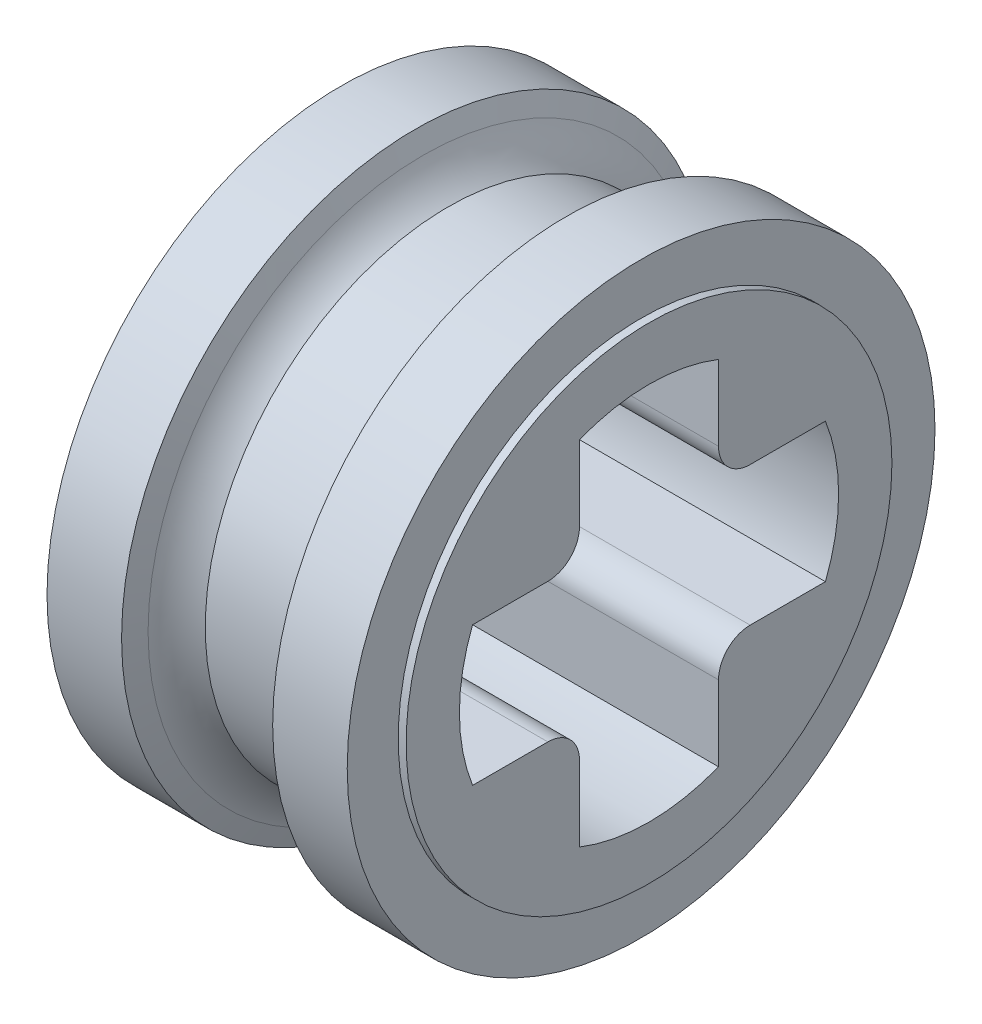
ISO-10303-21;
HEADER;
FILE_DESCRIPTION(('STEP AP214'),'2;1');
FILE_NAME('part.step','',(''),(''),'','','');
FILE_SCHEMA(('AUTOMOTIVE_DESIGN { 1 0 10303 214 1 1 1 1 }'));
ENDSEC;
DATA;
#1=APPLICATION_CONTEXT('core data for automotive mechanical design processes');
#2=APPLICATION_PROTOCOL_DEFINITION('international standard','automotive_design',2000,#1);
#3=PRODUCT_CONTEXT('',#1,'mechanical');
#4=PRODUCT('Part','Part','',(#3));
#5=PRODUCT_RELATED_PRODUCT_CATEGORY('part','',(#4));
#6=PRODUCT_DEFINITION_FORMATION('','',#4);
#7=PRODUCT_DEFINITION_CONTEXT('part definition',#1,'design');
#8=PRODUCT_DEFINITION('design','',#6,#7);
#9=PRODUCT_DEFINITION_SHAPE('','',#8);
#10=(LENGTH_UNIT() NAMED_UNIT(*) SI_UNIT(.MILLI.,.METRE.));
#11=(NAMED_UNIT(*) PLANE_ANGLE_UNIT() SI_UNIT($,.RADIAN.));
#12=(NAMED_UNIT(*) SI_UNIT($,.STERADIAN.) SOLID_ANGLE_UNIT());
#13=UNCERTAINTY_MEASURE_WITH_UNIT(LENGTH_MEASURE(1.E-05),#10,'distance_accuracy_value','');
#14=(GEOMETRIC_REPRESENTATION_CONTEXT(3) GLOBAL_UNCERTAINTY_ASSIGNED_CONTEXT((#13)) GLOBAL_UNIT_ASSIGNED_CONTEXT((#10,
#11,#12)) REPRESENTATION_CONTEXT('',''));
#15=CARTESIAN_POINT('',(0.,0.,0.));
#16=DIRECTION('',(0.,0.,1.));
#17=DIRECTION('',(1.,0.,0.));
#18=AXIS2_PLACEMENT_3D('',#15,#16,#17);
#19=CARTESIAN_POINT('',(-2.01625000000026,0.,0.));
#20=DIRECTION('',(1.,0.,0.));
#21=DIRECTION('',(0.,0.,-1.));
#22=AXIS2_PLACEMENT_3D('',#19,#20,#21);
#23=CYLINDRICAL_SURFACE('',#22,2.4);
#24=CARTESIAN_POINT('',(-2.,0.,0.));
#25=DIRECTION('',(-1.,0.,0.));
#26=DIRECTION('',(0.,0.,1.));
#27=AXIS2_PLACEMENT_3D('',#24,#25,#26);
#28=CIRCLE('',#27,2.4);
#29=CARTESIAN_POINT('',(-2.,2.23284571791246,-0.88));
#30=VERTEX_POINT('',#29);
#31=CARTESIAN_POINT('',(-2.,2.23284571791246,0.88));
#32=VERTEX_POINT('',#31);
#33=EDGE_CURVE('E49',#30,#32,#28,.F.);
#34=ORIENTED_EDGE('',*,*,#33,.F.);
#35=DIRECTION('',(1.,0.,0.));
#36=VECTOR('',#35,1.);
#37=CARTESIAN_POINT('',(-2.01625000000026,2.23284571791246,-0.88));
#38=LINE('',#37,#36);
#39=CARTESIAN_POINT('',(2.,2.23284571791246,-0.88));
#40=VERTEX_POINT('',#39);
#41=EDGE_CURVE('E319',#30,#40,#38,.T.);
#42=ORIENTED_EDGE('',*,*,#41,.T.);
#43=CARTESIAN_POINT('',(2.,0.,0.));
#44=DIRECTION('',(1.,0.,0.));
#45=DIRECTION('',(0.,0.,-1.));
#46=AXIS2_PLACEMENT_3D('',#43,#44,#45);
#47=CIRCLE('',#46,2.4);
#48=CARTESIAN_POINT('',(2.,2.23284571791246,0.88));
#49=VERTEX_POINT('',#48);
#50=EDGE_CURVE('E311',#49,#40,#47,.F.);
#51=ORIENTED_EDGE('',*,*,#50,.F.);
#52=DIRECTION('',(1.,0.,0.));
#53=VECTOR('',#52,1.);
#54=CARTESIAN_POINT('',(-2.01625000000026,2.23284571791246,0.88));
#55=LINE('',#54,#53);
#56=EDGE_CURVE('E161',#32,#49,#55,.T.);
#57=ORIENTED_EDGE('',*,*,#56,.F.);
#58=EDGE_LOOP('',(#34,#42,#51,#57));
#59=FACE_BOUND('',#58,.T.);
#60=ADVANCED_FACE('F34',(#59),#23,.F.);
#61=CARTESIAN_POINT('',(-2.01625000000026,1.28,-0.88));
#62=DIRECTION('',(0.,0.,-1.));
#63=DIRECTION('',(0.,1.,0.));
#64=AXIS2_PLACEMENT_3D('',#61,#62,#63);
#65=PLANE('',#64);
#66=DIRECTION('',(0.,1.,0.));
#67=VECTOR('',#66,1.);
#68=CARTESIAN_POINT('',(-2.,1.28,-0.88));
#69=LINE('',#68,#67);
#70=CARTESIAN_POINT('',(-2.,1.28,-0.88));
#71=VERTEX_POINT('',#70);
#72=EDGE_CURVE('E260',#71,#30,#69,.T.);
#73=ORIENTED_EDGE('',*,*,#72,.F.);
#74=DIRECTION('',(1.,0.,0.));
#75=VECTOR('',#74,1.);
#76=CARTESIAN_POINT('',(-2.01625000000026,1.28,-0.88));
#77=LINE('',#76,#75);
#78=CARTESIAN_POINT('',(2.,1.28,-0.88));
#79=VERTEX_POINT('',#78);
#80=EDGE_CURVE('E322',#71,#79,#77,.T.);
#81=ORIENTED_EDGE('',*,*,#80,.T.);
#82=DIRECTION('',(0.,-1.,0.));
#83=VECTOR('',#82,1.);
#84=CARTESIAN_POINT('',(2.,1.28,-0.88));
#85=LINE('',#84,#83);
#86=EDGE_CURVE('E308',#40,#79,#85,.T.);
#87=ORIENTED_EDGE('',*,*,#86,.F.);
#88=ORIENTED_EDGE('',*,*,#41,.F.);
#89=EDGE_LOOP('',(#73,#81,#87,#88));
#90=FACE_BOUND('',#89,.T.);
#91=ADVANCED_FACE('F205',(#90),#65,.F.);
#92=CARTESIAN_POINT('',(-2.01625000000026,1.28,-1.28));
#93=DIRECTION('',(1.,0.,0.));
#94=DIRECTION('',(0.,0.,-1.));
#95=AXIS2_PLACEMENT_3D('',#92,#93,#94);
#96=CYLINDRICAL_SURFACE('',#95,0.4);
#97=CARTESIAN_POINT('',(-2.,1.28,-1.28));
#98=DIRECTION('',(-1.,0.,0.));
#99=DIRECTION('',(0.,0.,1.));
#100=AXIS2_PLACEMENT_3D('',#97,#98,#99);
#101=CIRCLE('',#100,0.4);
#102=CARTESIAN_POINT('',(-2.,0.88,-1.28));
#103=VERTEX_POINT('',#102);
#104=EDGE_CURVE('E258',#103,#71,#101,.T.);
#105=ORIENTED_EDGE('',*,*,#104,.F.);
#106=DIRECTION('',(1.,0.,0.));
#107=VECTOR('',#106,1.);
#108=CARTESIAN_POINT('',(-2.01625000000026,0.88,-1.28));
#109=LINE('',#108,#107);
#110=CARTESIAN_POINT('',(2.,0.88,-1.28));
#111=VERTEX_POINT('',#110);
#112=EDGE_CURVE('E324',#103,#111,#109,.T.);
#113=ORIENTED_EDGE('',*,*,#112,.T.);
#114=CARTESIAN_POINT('',(2.,1.28,-1.28));
#115=DIRECTION('',(1.,0.,0.));
#116=DIRECTION('',(0.,0.,-1.));
#117=AXIS2_PLACEMENT_3D('',#114,#115,#116);
#118=CIRCLE('',#117,0.4);
#119=EDGE_CURVE('E305',#79,#111,#118,.T.);
#120=ORIENTED_EDGE('',*,*,#119,.F.);
#121=ORIENTED_EDGE('',*,*,#80,.F.);
#122=EDGE_LOOP('',(#105,#113,#120,#121));
#123=FACE_BOUND('',#122,.T.);
#124=ADVANCED_FACE('F211',(#123),#96,.T.);
#125=CARTESIAN_POINT('',(-2.01625000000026,0.88,-2.23284571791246));
#126=DIRECTION('',(0.,1.,0.));
#127=DIRECTION('',(0.,0.,1.));
#128=AXIS2_PLACEMENT_3D('',#125,#126,#127);
#129=PLANE('',#128);
#130=DIRECTION('',(0.,0.,1.));
#131=VECTOR('',#130,1.);
#132=CARTESIAN_POINT('',(-2.,0.88,-2.23284571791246));
#133=LINE('',#132,#131);
#134=CARTESIAN_POINT('',(-2.,0.88,-2.23284571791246));
#135=VERTEX_POINT('',#134);
#136=EDGE_CURVE('E256',#135,#103,#133,.T.);
#137=ORIENTED_EDGE('',*,*,#136,.F.);
#138=DIRECTION('',(1.,0.,0.));
#139=VECTOR('',#138,1.);
#140=CARTESIAN_POINT('',(-2.01625000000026,0.88,-2.23284571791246));
#141=LINE('',#140,#139);
#142=CARTESIAN_POINT('',(2.,0.88,-2.23284571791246));
#143=VERTEX_POINT('',#142);
#144=EDGE_CURVE('E326',#135,#143,#141,.T.);
#145=ORIENTED_EDGE('',*,*,#144,.T.);
#146=DIRECTION('',(0.,0.,-1.));
#147=VECTOR('',#146,1.);
#148=CARTESIAN_POINT('',(2.,0.88,-2.23284571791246));
#149=LINE('',#148,#147);
#150=EDGE_CURVE('E302',#111,#143,#149,.T.);
#151=ORIENTED_EDGE('',*,*,#150,.F.);
#152=ORIENTED_EDGE('',*,*,#112,.F.);
#153=EDGE_LOOP('',(#137,#145,#151,#152));
#154=FACE_BOUND('',#153,.T.);
#155=ADVANCED_FACE('F399',(#154),#129,.F.);
#156=CARTESIAN_POINT('',(-2.01625000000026,0.,0.));
#157=DIRECTION('',(1.,0.,0.));
#158=DIRECTION('',(0.,0.,-1.));
#159=AXIS2_PLACEMENT_3D('',#156,#157,#158);
#160=CYLINDRICAL_SURFACE('',#159,2.4);
#161=CARTESIAN_POINT('',(-2.,0.,0.));
#162=DIRECTION('',(-1.,0.,0.));
#163=DIRECTION('',(0.,0.,1.));
#164=AXIS2_PLACEMENT_3D('',#161,#162,#163);
#165=CIRCLE('',#164,2.4);
#166=CARTESIAN_POINT('',(-2.,-0.88,-2.23284571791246));
#167=VERTEX_POINT('',#166);
#168=EDGE_CURVE('E254',#167,#135,#165,.F.);
#169=ORIENTED_EDGE('',*,*,#168,.F.);
#170=DIRECTION('',(1.,0.,0.));
#171=VECTOR('',#170,1.);
#172=CARTESIAN_POINT('',(-2.01625000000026,-0.880000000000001,-2.23284571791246));
#173=LINE('',#172,#171);
#174=CARTESIAN_POINT('',(2.,-0.88,-2.23284571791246));
#175=VERTEX_POINT('',#174);
#176=EDGE_CURVE('E328',#167,#175,#173,.T.);
#177=ORIENTED_EDGE('',*,*,#176,.T.);
#178=CARTESIAN_POINT('',(2.,0.,0.));
#179=DIRECTION('',(1.,0.,0.));
#180=DIRECTION('',(0.,0.,-1.));
#181=AXIS2_PLACEMENT_3D('',#178,#179,#180);
#182=CIRCLE('',#181,2.4);
#183=EDGE_CURVE('E299',#143,#175,#182,.F.);
#184=ORIENTED_EDGE('',*,*,#183,.F.);
#185=ORIENTED_EDGE('',*,*,#144,.F.);
#186=EDGE_LOOP('',(#169,#177,#184,#185));
#187=FACE_BOUND('',#186,.T.);
#188=ADVANCED_FACE('F392',(#187),#160,.F.);
#189=CARTESIAN_POINT('',(-2.01625000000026,-0.88,-1.28));
#190=DIRECTION('',(0.,-1.,0.));
#191=DIRECTION('',(0.,0.,-1.));
#192=AXIS2_PLACEMENT_3D('',#189,#190,#191);
#193=PLANE('',#192);
#194=DIRECTION('',(0.,0.,-1.));
#195=VECTOR('',#194,1.);
#196=CARTESIAN_POINT('',(-2.,-0.88,-1.28));
#197=LINE('',#196,#195);
#198=CARTESIAN_POINT('',(-2.,-0.88,-1.28));
#199=VERTEX_POINT('',#198);
#200=EDGE_CURVE('E252',#199,#167,#197,.T.);
#201=ORIENTED_EDGE('',*,*,#200,.F.);
#202=DIRECTION('',(1.,0.,0.));
#203=VECTOR('',#202,1.);
#204=CARTESIAN_POINT('',(-2.01625000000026,-0.88,-1.28));
#205=LINE('',#204,#203);
#206=CARTESIAN_POINT('',(2.,-0.88,-1.28));
#207=VERTEX_POINT('',#206);
#208=EDGE_CURVE('E330',#199,#207,#205,.T.);
#209=ORIENTED_EDGE('',*,*,#208,.T.);
#210=DIRECTION('',(0.,0.,1.));
#211=VECTOR('',#210,1.);
#212=CARTESIAN_POINT('',(2.,-0.88,-1.28));
#213=LINE('',#212,#211);
#214=EDGE_CURVE('E296',#175,#207,#213,.T.);
#215=ORIENTED_EDGE('',*,*,#214,.F.);
#216=ORIENTED_EDGE('',*,*,#176,.F.);
#217=EDGE_LOOP('',(#201,#209,#215,#216));
#218=FACE_BOUND('',#217,.T.);
#219=ADVANCED_FACE('F389',(#218),#193,.F.);
#220=CARTESIAN_POINT('',(-2.01625000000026,-1.28,-1.28));
#221=DIRECTION('',(1.,0.,0.));
#222=DIRECTION('',(0.,0.,-1.));
#223=AXIS2_PLACEMENT_3D('',#220,#221,#222);
#224=CYLINDRICAL_SURFACE('',#223,0.4);
#225=CARTESIAN_POINT('',(-2.,-1.28,-1.28));
#226=DIRECTION('',(-1.,0.,0.));
#227=DIRECTION('',(0.,0.,1.));
#228=AXIS2_PLACEMENT_3D('',#225,#226,#227);
#229=CIRCLE('',#228,0.4);
#230=CARTESIAN_POINT('',(-2.,-1.28,-0.88));
#231=VERTEX_POINT('',#230);
#232=EDGE_CURVE('E250',#231,#199,#229,.T.);
#233=ORIENTED_EDGE('',*,*,#232,.F.);
#234=DIRECTION('',(1.,0.,0.));
#235=VECTOR('',#234,1.);
#236=CARTESIAN_POINT('',(-2.01625000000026,-1.28,-0.88));
#237=LINE('',#236,#235);
#238=CARTESIAN_POINT('',(2.,-1.28,-0.88));
#239=VERTEX_POINT('',#238);
#240=EDGE_CURVE('E332',#231,#239,#237,.T.);
#241=ORIENTED_EDGE('',*,*,#240,.T.);
#242=CARTESIAN_POINT('',(2.,-1.28,-1.28));
#243=DIRECTION('',(1.,0.,0.));
#244=DIRECTION('',(0.,0.,-1.));
#245=AXIS2_PLACEMENT_3D('',#242,#243,#244);
#246=CIRCLE('',#245,0.4);
#247=EDGE_CURVE('E293',#207,#239,#246,.T.);
#248=ORIENTED_EDGE('',*,*,#247,.F.);
#249=ORIENTED_EDGE('',*,*,#208,.F.);
#250=EDGE_LOOP('',(#233,#241,#248,#249));
#251=FACE_BOUND('',#250,.T.);
#252=ADVANCED_FACE('F384',(#251),#224,.T.);
#253=CARTESIAN_POINT('',(-2.01625000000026,-2.23284571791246,-0.88));
#254=DIRECTION('',(0.,0.,-1.));
#255=DIRECTION('',(0.,1.,0.));
#256=AXIS2_PLACEMENT_3D('',#253,#254,#255);
#257=PLANE('',#256);
#258=DIRECTION('',(0.,1.,0.));
#259=VECTOR('',#258,1.);
#260=CARTESIAN_POINT('',(-2.,-2.23284571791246,-0.88));
#261=LINE('',#260,#259);
#262=CARTESIAN_POINT('',(-2.,-2.23284571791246,-0.88));
#263=VERTEX_POINT('',#262);
#264=EDGE_CURVE('E248',#263,#231,#261,.T.);
#265=ORIENTED_EDGE('',*,*,#264,.F.);
#266=DIRECTION('',(1.,0.,0.));
#267=VECTOR('',#266,1.);
#268=CARTESIAN_POINT('',(-2.01625000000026,-2.23284571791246,-0.88));
#269=LINE('',#268,#267);
#270=CARTESIAN_POINT('',(2.,-2.23284571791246,-0.88));
#271=VERTEX_POINT('',#270);
#272=EDGE_CURVE('E334',#263,#271,#269,.T.);
#273=ORIENTED_EDGE('',*,*,#272,.T.);
#274=DIRECTION('',(0.,-1.,0.));
#275=VECTOR('',#274,1.);
#276=CARTESIAN_POINT('',(2.,-2.23284571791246,-0.88));
#277=LINE('',#276,#275);
#278=EDGE_CURVE('E290',#239,#271,#277,.T.);
#279=ORIENTED_EDGE('',*,*,#278,.F.);
#280=ORIENTED_EDGE('',*,*,#240,.F.);
#281=EDGE_LOOP('',(#265,#273,#279,#280));
#282=FACE_BOUND('',#281,.T.);
#283=ADVANCED_FACE('F377',(#282),#257,.F.);
#284=CARTESIAN_POINT('',(-2.01625000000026,0.,0.));
#285=DIRECTION('',(1.,0.,0.));
#286=DIRECTION('',(0.,0.,-1.));
#287=AXIS2_PLACEMENT_3D('',#284,#285,#286);
#288=CYLINDRICAL_SURFACE('',#287,2.4);
#289=CARTESIAN_POINT('',(-2.,0.,0.));
#290=DIRECTION('',(-1.,0.,0.));
#291=DIRECTION('',(0.,0.,1.));
#292=AXIS2_PLACEMENT_3D('',#289,#290,#291);
#293=CIRCLE('',#292,2.4);
#294=CARTESIAN_POINT('',(-2.,-2.23284571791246,0.88));
#295=VERTEX_POINT('',#294);
#296=EDGE_CURVE('E246',#295,#263,#293,.F.);
#297=ORIENTED_EDGE('',*,*,#296,.F.);
#298=DIRECTION('',(1.,0.,0.));
#299=VECTOR('',#298,1.);
#300=CARTESIAN_POINT('',(-2.01625000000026,-2.23284571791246,0.88));
#301=LINE('',#300,#299);
#302=CARTESIAN_POINT('',(2.,-2.23284571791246,0.88));
#303=VERTEX_POINT('',#302);
#304=EDGE_CURVE('E336',#295,#303,#301,.T.);
#305=ORIENTED_EDGE('',*,*,#304,.T.);
#306=CARTESIAN_POINT('',(2.,0.,0.));
#307=DIRECTION('',(1.,0.,0.));
#308=DIRECTION('',(0.,0.,-1.));
#309=AXIS2_PLACEMENT_3D('',#306,#307,#308);
#310=CIRCLE('',#309,2.4);
#311=EDGE_CURVE('E287',#271,#303,#310,.F.);
#312=ORIENTED_EDGE('',*,*,#311,.F.);
#313=ORIENTED_EDGE('',*,*,#272,.F.);
#314=EDGE_LOOP('',(#297,#305,#312,#313));
#315=FACE_BOUND('',#314,.T.);
#316=ADVANCED_FACE('F374',(#315),#288,.F.);
#317=CARTESIAN_POINT('',(-2.01625000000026,-1.28,0.88));
#318=DIRECTION('',(0.,0.,1.));
#319=DIRECTION('',(0.,-1.,0.));
#320=AXIS2_PLACEMENT_3D('',#317,#318,#319);
#321=PLANE('',#320);
#322=DIRECTION('',(0.,-1.,0.));
#323=VECTOR('',#322,1.);
#324=CARTESIAN_POINT('',(-2.,-1.28,0.88));
#325=LINE('',#324,#323);
#326=CARTESIAN_POINT('',(-2.,-1.28,0.88));
#327=VERTEX_POINT('',#326);
#328=EDGE_CURVE('E244',#327,#295,#325,.T.);
#329=ORIENTED_EDGE('',*,*,#328,.F.);
#330=DIRECTION('',(1.,0.,0.));
#331=VECTOR('',#330,1.);
#332=CARTESIAN_POINT('',(-2.01625000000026,-1.28,0.88));
#333=LINE('',#332,#331);
#334=CARTESIAN_POINT('',(2.,-1.28,0.88));
#335=VERTEX_POINT('',#334);
#336=EDGE_CURVE('E338',#327,#335,#333,.T.);
#337=ORIENTED_EDGE('',*,*,#336,.T.);
#338=DIRECTION('',(0.,1.,0.));
#339=VECTOR('',#338,1.);
#340=CARTESIAN_POINT('',(2.,-1.28,0.88));
#341=LINE('',#340,#339);
#342=EDGE_CURVE('E284',#303,#335,#341,.T.);
#343=ORIENTED_EDGE('',*,*,#342,.F.);
#344=ORIENTED_EDGE('',*,*,#304,.F.);
#345=EDGE_LOOP('',(#329,#337,#343,#344));
#346=FACE_BOUND('',#345,.T.);
#347=ADVANCED_FACE('F369',(#346),#321,.F.);
#348=CARTESIAN_POINT('',(-2.01625000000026,-1.28,1.28));
#349=DIRECTION('',(1.,0.,0.));
#350=DIRECTION('',(0.,0.,-1.));
#351=AXIS2_PLACEMENT_3D('',#348,#349,#350);
#352=CYLINDRICAL_SURFACE('',#351,0.4);
#353=CARTESIAN_POINT('',(-2.,-1.28,1.28));
#354=DIRECTION('',(-1.,0.,0.));
#355=DIRECTION('',(0.,0.,1.));
#356=AXIS2_PLACEMENT_3D('',#353,#354,#355);
#357=CIRCLE('',#356,0.4);
#358=CARTESIAN_POINT('',(-2.,-0.88,1.28));
#359=VERTEX_POINT('',#358);
#360=EDGE_CURVE('E242',#359,#327,#357,.T.);
#361=ORIENTED_EDGE('',*,*,#360,.F.);
#362=DIRECTION('',(1.,0.,0.));
#363=VECTOR('',#362,1.);
#364=CARTESIAN_POINT('',(-2.01625000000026,-0.88,1.28));
#365=LINE('',#364,#363);
#366=CARTESIAN_POINT('',(2.,-0.88,1.28));
#367=VERTEX_POINT('',#366);
#368=EDGE_CURVE('E340',#359,#367,#365,.T.);
#369=ORIENTED_EDGE('',*,*,#368,.T.);
#370=CARTESIAN_POINT('',(2.,-1.28,1.28));
#371=DIRECTION('',(1.,0.,0.));
#372=DIRECTION('',(0.,0.,-1.));
#373=AXIS2_PLACEMENT_3D('',#370,#371,#372);
#374=CIRCLE('',#373,0.4);
#375=EDGE_CURVE('E281',#335,#367,#374,.T.);
#376=ORIENTED_EDGE('',*,*,#375,.F.);
#377=ORIENTED_EDGE('',*,*,#336,.F.);
#378=EDGE_LOOP('',(#361,#369,#376,#377));
#379=FACE_BOUND('',#378,.T.);
#380=ADVANCED_FACE('F362',(#379),#352,.T.);
#381=CARTESIAN_POINT('',(-2.01625000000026,-0.88,2.23284571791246));
#382=DIRECTION('',(0.,-1.,0.));
#383=DIRECTION('',(0.,0.,-1.));
#384=AXIS2_PLACEMENT_3D('',#381,#382,#383);
#385=PLANE('',#384);
#386=DIRECTION('',(0.,0.,-1.));
#387=VECTOR('',#386,1.);
#388=CARTESIAN_POINT('',(-2.,-0.88,2.23284571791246));
#389=LINE('',#388,#387);
#390=CARTESIAN_POINT('',(-2.,-0.88,2.23284571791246));
#391=VERTEX_POINT('',#390);
#392=EDGE_CURVE('E240',#391,#359,#389,.T.);
#393=ORIENTED_EDGE('',*,*,#392,.F.);
#394=DIRECTION('',(1.,0.,0.));
#395=VECTOR('',#394,1.);
#396=CARTESIAN_POINT('',(-2.01625000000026,-0.88,2.23284571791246));
#397=LINE('',#396,#395);
#398=CARTESIAN_POINT('',(2.,-0.88,2.23284571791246));
#399=VERTEX_POINT('',#398);
#400=EDGE_CURVE('E342',#391,#399,#397,.T.);
#401=ORIENTED_EDGE('',*,*,#400,.T.);
#402=DIRECTION('',(0.,0.,1.));
#403=VECTOR('',#402,1.);
#404=CARTESIAN_POINT('',(2.,-0.88,2.23284571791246));
#405=LINE('',#404,#403);
#406=EDGE_CURVE('E278',#367,#399,#405,.T.);
#407=ORIENTED_EDGE('',*,*,#406,.F.);
#408=ORIENTED_EDGE('',*,*,#368,.F.);
#409=EDGE_LOOP('',(#393,#401,#407,#408));
#410=FACE_BOUND('',#409,.T.);
#411=ADVANCED_FACE('F359',(#410),#385,.F.);
#412=CARTESIAN_POINT('',(-2.01625000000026,0.,0.));
#413=DIRECTION('',(1.,0.,0.));
#414=DIRECTION('',(0.,0.,-1.));
#415=AXIS2_PLACEMENT_3D('',#412,#413,#414);
#416=CYLINDRICAL_SURFACE('',#415,2.4);
#417=CARTESIAN_POINT('',(-2.,0.,0.));
#418=DIRECTION('',(-1.,0.,0.));
#419=DIRECTION('',(0.,0.,1.));
#420=AXIS2_PLACEMENT_3D('',#417,#418,#419);
#421=CIRCLE('',#420,2.4);
#422=CARTESIAN_POINT('',(-2.,0.88,2.23284571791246));
#423=VERTEX_POINT('',#422);
#424=EDGE_CURVE('E238',#423,#391,#421,.F.);
#425=ORIENTED_EDGE('',*,*,#424,.F.);
#426=DIRECTION('',(1.,0.,0.));
#427=VECTOR('',#426,1.);
#428=CARTESIAN_POINT('',(-2.01625000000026,0.88,2.23284571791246));
#429=LINE('',#428,#427);
#430=CARTESIAN_POINT('',(2.,0.88,2.23284571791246));
#431=VERTEX_POINT('',#430);
#432=EDGE_CURVE('E163',#423,#431,#429,.T.);
#433=ORIENTED_EDGE('',*,*,#432,.T.);
#434=CARTESIAN_POINT('',(2.,0.,0.));
#435=DIRECTION('',(1.,0.,0.));
#436=DIRECTION('',(0.,0.,-1.));
#437=AXIS2_PLACEMENT_3D('',#434,#435,#436);
#438=CIRCLE('',#437,2.4);
#439=EDGE_CURVE('E275',#399,#431,#438,.F.);
#440=ORIENTED_EDGE('',*,*,#439,.F.);
#441=ORIENTED_EDGE('',*,*,#400,.F.);
#442=EDGE_LOOP('',(#425,#433,#440,#441));
#443=FACE_BOUND('',#442,.T.);
#444=ADVANCED_FACE('F347',(#443),#416,.F.);
#445=CARTESIAN_POINT('',(-2.01625000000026,0.88,1.28));
#446=DIRECTION('',(0.,1.,0.));
#447=DIRECTION('',(0.,0.,1.));
#448=AXIS2_PLACEMENT_3D('',#445,#446,#447);
#449=PLANE('',#448);
#450=DIRECTION('',(0.,0.,1.));
#451=VECTOR('',#450,1.);
#452=CARTESIAN_POINT('',(-2.,0.88,1.28));
#453=LINE('',#452,#451);
#454=CARTESIAN_POINT('',(-2.,0.88,1.28));
#455=VERTEX_POINT('',#454);
#456=EDGE_CURVE('E157',#455,#423,#453,.T.);
#457=ORIENTED_EDGE('',*,*,#456,.F.);
#458=DIRECTION('',(1.,0.,0.));
#459=VECTOR('',#458,1.);
#460=CARTESIAN_POINT('',(-2.01625000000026,0.88,1.28));
#461=LINE('',#460,#459);
#462=CARTESIAN_POINT('',(2.,0.88,1.28));
#463=VERTEX_POINT('',#462);
#464=EDGE_CURVE('E156',#455,#463,#461,.T.);
#465=ORIENTED_EDGE('',*,*,#464,.T.);
#466=DIRECTION('',(0.,0.,-1.));
#467=VECTOR('',#466,1.);
#468=CARTESIAN_POINT('',(2.,0.88,1.28));
#469=LINE('',#468,#467);
#470=EDGE_CURVE('E272',#431,#463,#469,.T.);
#471=ORIENTED_EDGE('',*,*,#470,.F.);
#472=ORIENTED_EDGE('',*,*,#432,.F.);
#473=EDGE_LOOP('',(#457,#465,#471,#472));
#474=FACE_BOUND('',#473,.T.);
#475=ADVANCED_FACE('F354',(#474),#449,.F.);
#476=CARTESIAN_POINT('',(-2.01625000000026,1.28,1.28));
#477=DIRECTION('',(1.,0.,0.));
#478=DIRECTION('',(0.,0.,-1.));
#479=AXIS2_PLACEMENT_3D('',#476,#477,#478);
#480=CYLINDRICAL_SURFACE('',#479,0.4);
#481=CARTESIAN_POINT('',(-2.,1.28,1.28));
#482=DIRECTION('',(-1.,0.,0.));
#483=DIRECTION('',(0.,0.,1.));
#484=AXIS2_PLACEMENT_3D('',#481,#482,#483);
#485=CIRCLE('',#484,0.4);
#486=CARTESIAN_POINT('',(-2.,1.28,0.88));
#487=VERTEX_POINT('',#486);
#488=EDGE_CURVE('E148',#487,#455,#485,.T.);
#489=ORIENTED_EDGE('',*,*,#488,.F.);
#490=DIRECTION('',(1.,0.,0.));
#491=VECTOR('',#490,1.);
#492=CARTESIAN_POINT('',(-2.01625000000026,1.28,0.88));
#493=LINE('',#492,#491);
#494=CARTESIAN_POINT('',(2.,1.28,0.88));
#495=VERTEX_POINT('',#494);
#496=EDGE_CURVE('E57',#487,#495,#493,.T.);
#497=ORIENTED_EDGE('',*,*,#496,.T.);
#498=CARTESIAN_POINT('',(2.,1.28,1.28));
#499=DIRECTION('',(1.,0.,0.));
#500=DIRECTION('',(0.,0.,-1.));
#501=AXIS2_PLACEMENT_3D('',#498,#499,#500);
#502=CIRCLE('',#501,0.4);
#503=EDGE_CURVE('E270',#463,#495,#502,.T.);
#504=ORIENTED_EDGE('',*,*,#503,.F.);
#505=ORIENTED_EDGE('',*,*,#464,.F.);
#506=EDGE_LOOP('',(#489,#497,#504,#505));
#507=FACE_BOUND('',#506,.T.);
#508=ADVANCED_FACE('F155',(#507),#480,.T.);
#509=CARTESIAN_POINT('',(-2.01625000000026,2.23284571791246,0.88));
#510=DIRECTION('',(0.,0.,1.));
#511=DIRECTION('',(0.,-1.,0.));
#512=AXIS2_PLACEMENT_3D('',#509,#510,#511);
#513=PLANE('',#512);
#514=DIRECTION('',(0.,-1.,0.));
#515=VECTOR('',#514,1.);
#516=CARTESIAN_POINT('',(-2.,2.23284571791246,0.88));
#517=LINE('',#516,#515);
#518=EDGE_CURVE('E146',#32,#487,#517,.T.);
#519=ORIENTED_EDGE('',*,*,#518,.F.);
#520=ORIENTED_EDGE('',*,*,#56,.T.);
#521=DIRECTION('',(0.,1.,0.));
#522=VECTOR('',#521,1.);
#523=CARTESIAN_POINT('',(2.,2.23284571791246,0.88));
#524=LINE('',#523,#522);
#525=EDGE_CURVE('E11',#495,#49,#524,.T.);
#526=ORIENTED_EDGE('',*,*,#525,.F.);
#527=ORIENTED_EDGE('',*,*,#496,.F.);
#528=EDGE_LOOP('',(#519,#520,#526,#527));
#529=FACE_BOUND('',#528,.T.);
#530=ADVANCED_FACE('F160',(#529),#513,.F.);
#531=CARTESIAN_POINT('',(-2.01625000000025,0.,0.));
#532=DIRECTION('',(1.,0.,0.));
#533=DIRECTION('',(0.,0.,-1.));
#534=AXIS2_PLACEMENT_3D('',#531,#532,#533);
#535=CYLINDRICAL_SURFACE('',#534,3.075);
#536=CARTESIAN_POINT('',(-1.9,0.,0.));
#537=DIRECTION('',(1.,0.,0.));
#538=DIRECTION('',(0.,0.,-1.));
#539=AXIS2_PLACEMENT_3D('',#536,#537,#538);
#540=CIRCLE('',#539,3.075);
#541=CARTESIAN_POINT('',(-1.9,0.,-3.075));
#542=VERTEX_POINT('',#541);
#543=EDGE_CURVE('E231',#542,#542,#540,.T.);
#544=ORIENTED_EDGE('',*,*,#543,.F.);
#545=EDGE_LOOP('',(#544));
#546=FACE_BOUND('',#545,.T.);
#547=CARTESIAN_POINT('',(-2.,0.,0.));
#548=DIRECTION('',(1.,0.,0.));
#549=DIRECTION('',(0.,0.,-1.));
#550=AXIS2_PLACEMENT_3D('',#547,#548,#549);
#551=CIRCLE('',#550,3.075);
#552=CARTESIAN_POINT('',(-2.,0.,-3.075));
#553=VERTEX_POINT('',#552);
#554=EDGE_CURVE('E152',#553,#553,#551,.T.);
#555=ORIENTED_EDGE('',*,*,#554,.T.);
#556=EDGE_LOOP('',(#555));
#557=FACE_BOUND('',#556,.T.);
#558=ADVANCED_FACE('F221',(#546,#557),#535,.T.);
#559=CARTESIAN_POINT('',(-0.956250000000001,0.,0.));
#560=DIRECTION('',(-1.,0.,0.));
#561=DIRECTION('',(0.,0.,1.));
#562=AXIS2_PLACEMENT_3D('',#559,#560,#561);
#563=CYLINDRICAL_SURFACE('',#562,3.72);
#564=CARTESIAN_POINT('',(-0.956250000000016,0.,0.));
#565=DIRECTION('',(-1.,0.,0.));
#566=DIRECTION('',(0.,0.,-1.));
#567=AXIS2_PLACEMENT_3D('',#564,#565,#566);
#568=CIRCLE('',#567,3.71999999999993);
#569=CARTESIAN_POINT('',(-0.956250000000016,0.,-3.71999999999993));
#570=VERTEX_POINT('',#569);
#571=EDGE_CURVE('E321',#570,#570,#568,.T.);
#572=ORIENTED_EDGE('',*,*,#571,.T.);
#573=EDGE_LOOP('',(#572));
#574=FACE_BOUND('',#573,.T.);
#575=CARTESIAN_POINT('',(-1.9,0.,0.));
#576=DIRECTION('',(1.,0.,0.));
#577=DIRECTION('',(0.,0.,-1.));
#578=AXIS2_PLACEMENT_3D('',#575,#576,#577);
#579=CIRCLE('',#578,3.72);
#580=CARTESIAN_POINT('',(-1.9,0.,-3.72));
#581=VERTEX_POINT('',#580);
#582=EDGE_CURVE('E264',#581,#581,#579,.T.);
#583=ORIENTED_EDGE('',*,*,#582,.T.);
#584=EDGE_LOOP('',(#583));
#585=FACE_BOUND('',#584,.T.);
#586=ADVANCED_FACE('F200',(#574,#585),#563,.T.);
#587=CARTESIAN_POINT('',(1.91624999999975,0.,0.));
#588=DIRECTION('',(1.,0.,0.));
#589=DIRECTION('',(0.,0.,-1.));
#590=AXIS2_PLACEMENT_3D('',#587,#588,#589);
#591=CYLINDRICAL_SURFACE('',#590,3.075);
#592=CARTESIAN_POINT('',(1.9,0.,0.));
#593=DIRECTION('',(1.,0.,0.));
#594=DIRECTION('',(0.,0.,-1.));
#595=AXIS2_PLACEMENT_3D('',#592,#593,#594);
#596=CIRCLE('',#595,3.075);
#597=CARTESIAN_POINT('',(1.9,0.,-3.075));
#598=VERTEX_POINT('',#597);
#599=EDGE_CURVE('E314',#598,#598,#596,.T.);
#600=ORIENTED_EDGE('',*,*,#599,.T.);
#601=EDGE_LOOP('',(#600));
#602=FACE_BOUND('',#601,.T.);
#603=CARTESIAN_POINT('',(2.,0.,0.));
#604=DIRECTION('',(1.,0.,0.));
#605=DIRECTION('',(0.,0.,-1.));
#606=AXIS2_PLACEMENT_3D('',#603,#604,#605);
#607=CIRCLE('',#606,3.075);
#608=CARTESIAN_POINT('',(2.,0.,-3.075));
#609=VERTEX_POINT('',#608);
#610=EDGE_CURVE('E267',#609,#609,#607,.T.);
#611=ORIENTED_EDGE('',*,*,#610,.F.);
#612=EDGE_LOOP('',(#611));
#613=FACE_BOUND('',#612,.T.);
#614=ADVANCED_FACE('F36',(#602,#613),#591,.T.);
#615=CARTESIAN_POINT('',(1.91625,0.,0.));
#616=DIRECTION('',(-1.,0.,0.));
#617=DIRECTION('',(0.,0.,1.));
#618=AXIS2_PLACEMENT_3D('',#615,#616,#617);
#619=CYLINDRICAL_SURFACE('',#618,3.72);
#620=CARTESIAN_POINT('',(0.956250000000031,0.,0.));
#621=DIRECTION('',(-1.,0.,0.));
#622=DIRECTION('',(0.,0.,-1.));
#623=AXIS2_PLACEMENT_3D('',#620,#621,#622);
#624=CIRCLE('',#623,3.72);
#625=CARTESIAN_POINT('',(0.956250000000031,0.,-3.72));
#626=VERTEX_POINT('',#625);
#627=EDGE_CURVE('E172',#626,#626,#624,.T.);
#628=ORIENTED_EDGE('',*,*,#627,.F.);
#629=EDGE_LOOP('',(#628));
#630=FACE_BOUND('',#629,.T.);
#631=CARTESIAN_POINT('',(1.9,0.,0.));
#632=DIRECTION('',(1.,0.,0.));
#633=DIRECTION('',(0.,0.,-1.));
#634=AXIS2_PLACEMENT_3D('',#631,#632,#633);
#635=CIRCLE('',#634,3.72);
#636=CARTESIAN_POINT('',(1.9,0.,-3.72));
#637=VERTEX_POINT('',#636);
#638=EDGE_CURVE('E165',#637,#637,#635,.T.);
#639=ORIENTED_EDGE('',*,*,#638,.F.);
#640=EDGE_LOOP('',(#639));
#641=FACE_BOUND('',#640,.T.);
#642=ADVANCED_FACE('F192',(#630,#641),#619,.T.);
#643=CARTESIAN_POINT('',(0.,0.,0.));
#644=DIRECTION('',(-1.,0.,0.));
#645=DIRECTION('',(0.,0.,-1.));
#646=AXIS2_PLACEMENT_3D('',#643,#644,#645);
#647=TOROIDAL_SURFACE('',#646,3.827,0.927);
#648=CARTESIAN_POINT('',(-0.542056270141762,0.,0.));
#649=DIRECTION('',(-1.,0.,0.));
#650=DIRECTION('',(0.,0.,1.));
#651=AXIS2_PLACEMENT_3D('',#648,#649,#650);
#652=CIRCLE('',#651,3.075);
#653=CARTESIAN_POINT('',(-0.542056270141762,0.,-3.075));
#654=VERTEX_POINT('',#653);
#655=EDGE_CURVE('E42',#654,#654,#652,.F.);
#656=ORIENTED_EDGE('',*,*,#655,.F.);
#657=EDGE_LOOP('',(#656));
#658=FACE_BOUND('',#657,.T.);
#659=CARTESIAN_POINT('',(-0.859898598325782,0.,0.));
#660=DIRECTION('',(-1.,0.,0.));
#661=DIRECTION('',(0.,0.,-1.));
#662=AXIS2_PLACEMENT_3D('',#659,#660,#661);
#663=CIRCLE('',#662,3.48072929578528);
#664=CARTESIAN_POINT('',(-0.859898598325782,0.,-3.48072929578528));
#665=VERTEX_POINT('',#664);
#666=EDGE_CURVE('E621',#665,#665,#663,.F.);
#667=ORIENTED_EDGE('',*,*,#666,.T.);
#668=EDGE_LOOP('',(#667));
#669=FACE_BOUND('',#668,.T.);
#670=ADVANCED_FACE('F186',(#658,#669),#647,.F.);
#671=CARTESIAN_POINT('',(-0.859898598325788,0.,0.));
#672=DIRECTION('',(-1.,0.,0.));
#673=DIRECTION('',(0.,-1.,0.));
#674=AXIS2_PLACEMENT_3D('',#671,#672,#673);
#675=CONICAL_SURFACE('',#674,3.48072929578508,1.18797500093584);
#676=ORIENTED_EDGE('',*,*,#571,.F.);
#677=EDGE_LOOP('',(#676));
#678=FACE_BOUND('',#677,.T.);
#679=ORIENTED_EDGE('',*,*,#666,.F.);
#680=EDGE_LOOP('',(#679));
#681=FACE_BOUND('',#680,.T.);
#682=ADVANCED_FACE('F187',(#678,#681),#675,.T.);
#683=CARTESIAN_POINT('',(-10.7136634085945,0.,0.));
#684=DIRECTION('',(1.,0.,0.));
#685=DIRECTION('',(0.,0.,-1.));
#686=AXIS2_PLACEMENT_3D('',#683,#684,#685);
#687=CYLINDRICAL_SURFACE('',#686,3.075);
#688=CARTESIAN_POINT('',(0.542056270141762,0.,0.));
#689=DIRECTION('',(-1.,0.,0.));
#690=DIRECTION('',(0.,0.,1.));
#691=AXIS2_PLACEMENT_3D('',#688,#689,#690);
#692=CIRCLE('',#691,3.075);
#693=CARTESIAN_POINT('',(0.542056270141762,0.,-3.075));
#694=VERTEX_POINT('',#693);
#695=EDGE_CURVE('E169',#694,#694,#692,.T.);
#696=CARTESIAN_POINT('',(-0.542056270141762,0.,-3.075));
#697=CARTESIAN_POINT('',(-0.530763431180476,0.,-3.075));
#698=CARTESIAN_POINT('',(-0.519470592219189,0.,-3.075));
#699=CARTESIAN_POINT('',(-0.496884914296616,0.,-3.075));
#700=CARTESIAN_POINT('',(-0.485592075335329,0.,-3.075));
#701=CARTESIAN_POINT('',(-0.463006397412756,0.,-3.075));
#702=CARTESIAN_POINT('',(-0.451713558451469,0.,-3.075));
#703=CARTESIAN_POINT('',(-0.429127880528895,0.,-3.075));
#704=CARTESIAN_POINT('',(-0.417835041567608,0.,-3.075));
#705=CARTESIAN_POINT('',(-0.395249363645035,0.,-3.075));
#706=CARTESIAN_POINT('',(-0.383956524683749,0.,-3.075));
#707=CARTESIAN_POINT('',(-0.361370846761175,0.,-3.075));
#708=CARTESIAN_POINT('',(-0.350078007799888,0.,-3.075));
#709=CARTESIAN_POINT('',(-0.327492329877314,0.,-3.075));
#710=CARTESIAN_POINT('',(-0.316199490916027,0.,-3.075));
#711=CARTESIAN_POINT('',(-0.293613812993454,0.,-3.075));
#712=CARTESIAN_POINT('',(-0.282320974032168,0.,-3.075));
#713=CARTESIAN_POINT('',(-0.259735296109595,0.,-3.075));
#714=CARTESIAN_POINT('',(-0.248442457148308,0.,-3.075));
#715=CARTESIAN_POINT('',(-0.225856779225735,0.,-3.075));
#716=CARTESIAN_POINT('',(-0.214563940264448,0.,-3.075));
#717=CARTESIAN_POINT('',(-0.191978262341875,0.,-3.075));
#718=CARTESIAN_POINT('',(-0.180685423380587,0.,-3.075));
#719=CARTESIAN_POINT('',(-0.158099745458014,0.,-3.075));
#720=CARTESIAN_POINT('',(-0.146806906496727,0.,-3.075));
#721=CARTESIAN_POINT('',(-0.124221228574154,0.,-3.075));
#722=CARTESIAN_POINT('',(-0.112928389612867,0.,-3.075));
#723=CARTESIAN_POINT('',(-0.0903427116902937,0.,-3.075));
#724=CARTESIAN_POINT('',(-0.0790498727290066,0.,-3.075));
#725=CARTESIAN_POINT('',(-0.0564641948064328,0.,-3.075));
#726=CARTESIAN_POINT('',(-0.0451713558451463,0.,-3.075));
#727=CARTESIAN_POINT('',(-0.0225856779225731,0.,-3.075));
#728=CARTESIAN_POINT('',(-0.0112928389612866,0.,-3.075));
#729=CARTESIAN_POINT('',(0.0112928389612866,0.,-3.075));
#730=CARTESIAN_POINT('',(0.0225856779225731,0.,-3.075));
#731=CARTESIAN_POINT('',(0.0451713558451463,0.,-3.075));
#732=CARTESIAN_POINT('',(0.0564641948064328,0.,-3.075));
#733=CARTESIAN_POINT('',(0.0790498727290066,0.,-3.075));
#734=CARTESIAN_POINT('',(0.0903427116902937,0.,-3.075));
#735=CARTESIAN_POINT('',(0.112928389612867,0.,-3.075));
#736=CARTESIAN_POINT('',(0.124221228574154,0.,-3.075));
#737=CARTESIAN_POINT('',(0.146806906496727,0.,-3.075));
#738=CARTESIAN_POINT('',(0.158099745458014,0.,-3.075));
#739=CARTESIAN_POINT('',(0.180685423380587,0.,-3.075));
#740=CARTESIAN_POINT('',(0.191978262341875,0.,-3.075));
#741=CARTESIAN_POINT('',(0.214563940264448,0.,-3.075));
#742=CARTESIAN_POINT('',(0.225856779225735,0.,-3.075));
#743=CARTESIAN_POINT('',(0.248442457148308,0.,-3.075));
#744=CARTESIAN_POINT('',(0.259735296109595,0.,-3.075));
#745=CARTESIAN_POINT('',(0.282320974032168,0.,-3.075));
#746=CARTESIAN_POINT('',(0.293613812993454,0.,-3.075));
#747=CARTESIAN_POINT('',(0.316199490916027,0.,-3.075));
#748=CARTESIAN_POINT('',(0.327492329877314,0.,-3.075));
#749=CARTESIAN_POINT('',(0.350078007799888,0.,-3.075));
#750=CARTESIAN_POINT('',(0.361370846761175,0.,-3.075));
#751=CARTESIAN_POINT('',(0.383956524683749,0.,-3.075));
#752=CARTESIAN_POINT('',(0.395249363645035,0.,-3.075));
#753=CARTESIAN_POINT('',(0.417835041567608,0.,-3.075));
#754=CARTESIAN_POINT('',(0.429127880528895,0.,-3.075));
#755=CARTESIAN_POINT('',(0.451713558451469,0.,-3.075));
#756=CARTESIAN_POINT('',(0.463006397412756,0.,-3.075));
#757=CARTESIAN_POINT('',(0.485592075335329,0.,-3.075));
#758=CARTESIAN_POINT('',(0.496884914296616,0.,-3.075));
#759=CARTESIAN_POINT('',(0.519470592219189,0.,-3.075));
#760=CARTESIAN_POINT('',(0.530763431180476,0.,-3.075));
#761=CARTESIAN_POINT('',(0.542056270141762,0.,-3.075));
#762=B_SPLINE_CURVE_WITH_KNOTS('',3,(#696,#697,#698,#699,#700,#701,#702,#703,#704,#705,#706,
#707,#708,#709,#710,#711,#712,#713,#714,#715,#716,#717,#718,#719,#720,#721,#722,#723,#724,#725,
#726,#727,#728,#729,#730,#731,#732,#733,#734,#735,#736,#737,#738,#739,#740,#741,#742,#743,#744,
#745,#746,#747,#748,#749,#750,#751,#752,#753,#754,#755,#756,#757,#758,#759,#760,#761),
.UNSPECIFIED.,.F.,.F.,(4,2,2,2,2,2,2,2,2,2,2,2,2,2,2,2,2,2,2,2,2,2,2,2,2,2,2,2,2,2,2,2,4),(0.,
0.0338785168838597,0.0677570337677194,0.101635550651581,0.135514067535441,0.1693925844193,
0.203271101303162,0.237149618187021,0.271028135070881,0.304906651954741,0.338785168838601,
0.372663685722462,0.406542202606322,0.440420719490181,0.474299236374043,0.508177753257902,
0.542056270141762,0.575934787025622,0.609813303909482,0.643691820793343,0.677570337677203,
0.711448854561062,0.745327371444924,0.779205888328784,0.813084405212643,0.846962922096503,
0.880841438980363,0.914719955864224,0.948598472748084,0.982476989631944,1.0163555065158,
1.05023402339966,1.08411254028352),.UNSPECIFIED.);
#763=EDGE_CURVE('BSEAM190',#654,#694,#762,.T.);
#764=ORIENTED_EDGE('',*,*,#655,.T.);
#765=ORIENTED_EDGE('',*,*,#695,.T.);
#766=ORIENTED_EDGE('',*,*,#763,.T.);
#767=ORIENTED_EDGE('',*,*,#763,.F.);
#768=EDGE_LOOP('',(#764,#766,#765,#767));
#769=FACE_BOUND('',#768,.T.);
#770=ADVANCED_FACE('F190',(#769),#687,.T.);
#771=CARTESIAN_POINT('',(0.956250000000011,0.,0.));
#772=DIRECTION('',(1.,0.,0.));
#773=DIRECTION('',(0.,0.,-1.));
#774=AXIS2_PLACEMENT_3D('',#771,#772,#773);
#775=CONICAL_SURFACE('',#774,3.71999999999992,1.18797500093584);
#776=CARTESIAN_POINT('',(0.859898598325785,0.,0.));
#777=DIRECTION('',(-1.,0.,0.));
#778=DIRECTION('',(0.,0.,-1.));
#779=AXIS2_PLACEMENT_3D('',#776,#777,#778);
#780=CIRCLE('',#779,3.48072929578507);
#781=CARTESIAN_POINT('',(0.859898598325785,0.,-3.48072929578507));
#782=VERTEX_POINT('',#781);
#783=EDGE_CURVE('E623',#782,#782,#780,.T.);
#784=ORIENTED_EDGE('',*,*,#783,.F.);
#785=EDGE_LOOP('',(#784));
#786=FACE_BOUND('',#785,.T.);
#787=ORIENTED_EDGE('',*,*,#627,.T.);
#788=EDGE_LOOP('',(#787));
#789=FACE_BOUND('',#788,.T.);
#790=ADVANCED_FACE('F184',(#786,#789),#775,.T.);
#791=ORIENTED_EDGE('',*,*,#695,.F.);
#792=EDGE_LOOP('',(#791));
#793=FACE_BOUND('',#792,.T.);
#794=ORIENTED_EDGE('',*,*,#783,.T.);
#795=EDGE_LOOP('',(#794));
#796=FACE_BOUND('',#795,.T.);
#797=ADVANCED_FACE('F179',(#793,#796),#647,.F.);
#798=CARTESIAN_POINT('',(1.9,0.,0.));
#799=DIRECTION('',(1.,0.,0.));
#800=DIRECTION('',(0.,0.,-1.));
#801=AXIS2_PLACEMENT_3D('',#798,#799,#800);
#802=PLANE('',#801);
#803=ORIENTED_EDGE('',*,*,#599,.F.);
#804=EDGE_LOOP('',(#803));
#805=FACE_BOUND('',#804,.T.);
#806=ORIENTED_EDGE('',*,*,#638,.T.);
#807=EDGE_LOOP('',(#806));
#808=FACE_BOUND('',#807,.T.);
#809=ADVANCED_FACE('F183',(#805,#808),#802,.T.);
#810=CARTESIAN_POINT('',(2.,0.,0.));
#811=DIRECTION('',(1.,0.,0.));
#812=DIRECTION('',(0.,0.,-1.));
#813=AXIS2_PLACEMENT_3D('',#810,#811,#812);
#814=PLANE('',#813);
#815=ORIENTED_EDGE('',*,*,#610,.T.);
#816=EDGE_LOOP('',(#815));
#817=FACE_BOUND('',#816,.T.);
#818=ORIENTED_EDGE('',*,*,#50,.T.);
#819=ORIENTED_EDGE('',*,*,#86,.T.);
#820=ORIENTED_EDGE('',*,*,#119,.T.);
#821=ORIENTED_EDGE('',*,*,#150,.T.);
#822=ORIENTED_EDGE('',*,*,#183,.T.);
#823=ORIENTED_EDGE('',*,*,#214,.T.);
#824=ORIENTED_EDGE('',*,*,#247,.T.);
#825=ORIENTED_EDGE('',*,*,#278,.T.);
#826=ORIENTED_EDGE('',*,*,#311,.T.);
#827=ORIENTED_EDGE('',*,*,#342,.T.);
#828=ORIENTED_EDGE('',*,*,#375,.T.);
#829=ORIENTED_EDGE('',*,*,#406,.T.);
#830=ORIENTED_EDGE('',*,*,#439,.T.);
#831=ORIENTED_EDGE('',*,*,#470,.T.);
#832=ORIENTED_EDGE('',*,*,#503,.T.);
#833=ORIENTED_EDGE('',*,*,#525,.T.);
#834=EDGE_LOOP('',(#818,#819,#820,#821,#822,#823,#824,#825,#826,#827,#828,#829,#830,#831,#832,#833));
#835=FACE_BOUND('',#834,.T.);
#836=ADVANCED_FACE('F352',(#817,#835),#814,.T.);
#837=CARTESIAN_POINT('',(-1.9,0.,0.));
#838=DIRECTION('',(-1.,0.,0.));
#839=DIRECTION('',(0.,0.,-1.));
#840=AXIS2_PLACEMENT_3D('',#837,#838,#839);
#841=PLANE('',#840);
#842=ORIENTED_EDGE('',*,*,#582,.F.);
#843=EDGE_LOOP('',(#842));
#844=FACE_BOUND('',#843,.T.);
#845=ORIENTED_EDGE('',*,*,#543,.T.);
#846=EDGE_LOOP('',(#845));
#847=FACE_BOUND('',#846,.T.);
#848=ADVANCED_FACE('F461',(#844,#847),#841,.T.);
#849=CARTESIAN_POINT('',(-2.,0.,0.));
#850=DIRECTION('',(-1.,0.,0.));
#851=DIRECTION('',(0.,0.,-1.));
#852=AXIS2_PLACEMENT_3D('',#849,#850,#851);
#853=PLANE('',#852);
#854=ORIENTED_EDGE('',*,*,#554,.F.);
#855=EDGE_LOOP('',(#854));
#856=FACE_BOUND('',#855,.T.);
#857=ORIENTED_EDGE('',*,*,#33,.T.);
#858=ORIENTED_EDGE('',*,*,#518,.T.);
#859=ORIENTED_EDGE('',*,*,#488,.T.);
#860=ORIENTED_EDGE('',*,*,#456,.T.);
#861=ORIENTED_EDGE('',*,*,#424,.T.);
#862=ORIENTED_EDGE('',*,*,#392,.T.);
#863=ORIENTED_EDGE('',*,*,#360,.T.);
#864=ORIENTED_EDGE('',*,*,#328,.T.);
#865=ORIENTED_EDGE('',*,*,#296,.T.);
#866=ORIENTED_EDGE('',*,*,#264,.T.);
#867=ORIENTED_EDGE('',*,*,#232,.T.);
#868=ORIENTED_EDGE('',*,*,#200,.T.);
#869=ORIENTED_EDGE('',*,*,#168,.T.);
#870=ORIENTED_EDGE('',*,*,#136,.T.);
#871=ORIENTED_EDGE('',*,*,#104,.T.);
#872=ORIENTED_EDGE('',*,*,#72,.T.);
#873=EDGE_LOOP('',(#857,#858,#859,#860,#861,#862,#863,#864,#865,#866,#867,#868,#869,#870,#871,#872));
#874=FACE_BOUND('',#873,.T.);
#875=ADVANCED_FACE('F147',(#856,#874),#853,.T.);
#876=CLOSED_SHELL('',(#60,#91,#124,#155,#188,#219,#252,#283,#316,#347,#380,#411,#444,#475,#508,
#530,#558,#586,#614,#642,#670,#682,#770,#790,#797,#809,#836,#848,#875));
#877=MANIFOLD_SOLID_BREP('B2',#876);
#878=ADVANCED_BREP_SHAPE_REPRESENTATION('',(#18,#877),#14);
#879=SHAPE_DEFINITION_REPRESENTATION(#9,#878);
ENDSEC;
END-ISO-10303-21;
